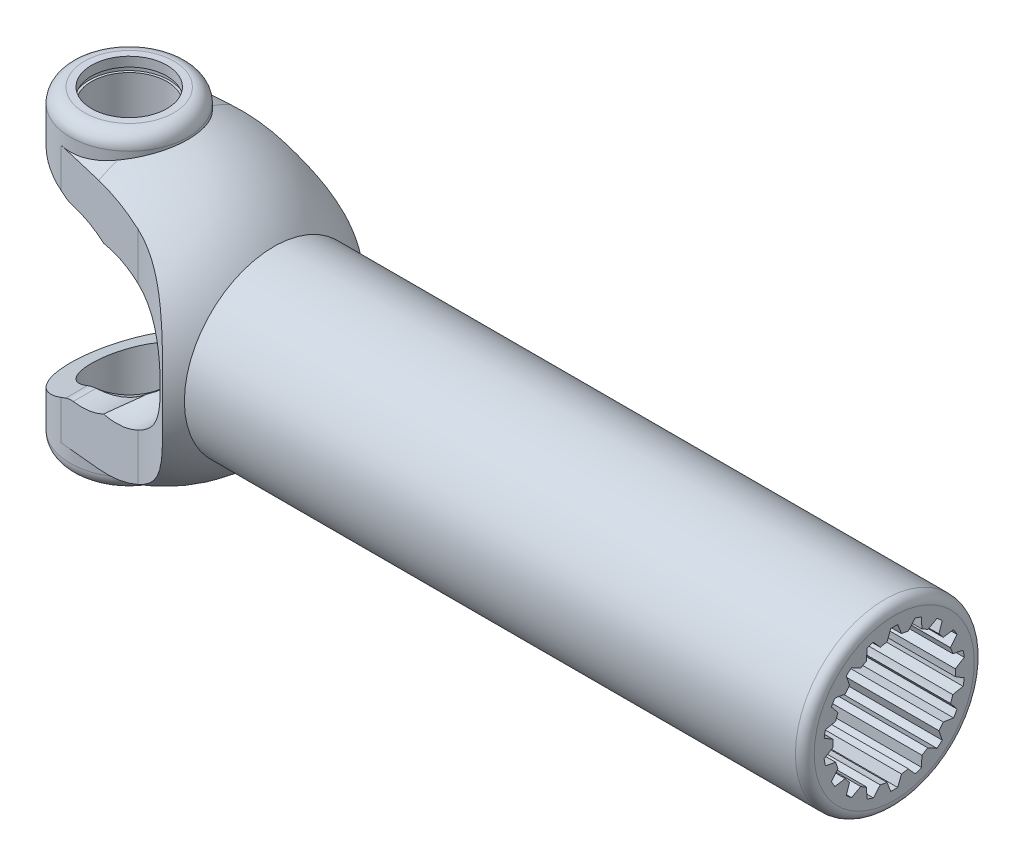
from build123d import *
from build123d.topology import SkipClean

# Parameters (mm, degrees)
CUT_EXTRUDE1_DEPTH      = 168.94716431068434
CUT_EXTRUDE1_DEPTH_BACK = 168.94716431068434
CUT_EXTRUDE2_DEPTH      = 167.62907912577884
CUT_EXTRUDE2_DEPTH_BACK = 167.62907912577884
FILLET1_R               = 5
SKETCH5_R               = 8
CUT_EXTRUDE3_DEPTH      = 177.69535931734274
SKETCH6_W               = 0.5
SKETCH6_H               = 1
CUT_EXTRUDE4_DEPTH      = 110
CIRPATTERN1_COUNT       = 18
FILLET2_R               = 2


with BuildPart() as part:
    # Sketch1 → Revolve1 (revolve)
    with BuildSketch(Plane.XY, mode=Mode.PRIVATE) as revolve1_sk:
        with BuildLine():
            Line((-12.5, 0), (162.49999999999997, 0))
            Line((162.49999999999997, 0), (162.5, 19))
            Line((162.5, 19), (30.716373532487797, 19))
            ThreePointArc((30.716373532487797, 19), (20.345232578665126, 27.110883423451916), (7.4999999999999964, 30.000000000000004))
            Line((7.4999999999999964, 30.000000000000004), (-12.500000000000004, 30))
            Line((-12.500000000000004, 30), (-12.5, 0))
        make_face()
    revolve(revolve1_sk.sketch.rotate(Axis((-12.5, 0, 0), (1, 0, 0)), 90), axis=Axis((-12.5, 0, 0), (1, 0, 0)))

    # Sketch2 → Cut-Extrude1 (cut, two sides: drawn at the far end of the back side and taken through both)
    with BuildSketch(Plane(origin=(0, 0, 0), x_dir=(1, 0, 0), z_dir=(0, 1, 0)).offset(-CUT_EXTRUDE1_DEPTH_BACK)):
        with BuildLine():
            Line((28.500000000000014, -21.424285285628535), (28.500000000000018, -41.42428528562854))
            Line((28.500000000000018, -41.42428528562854), (-41.499999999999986, -41.42428528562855))
            Line((-41.499999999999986, -41.42428528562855), (-41.499999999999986, 41.42428528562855))
            Line((-41.499999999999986, 41.42428528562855), (28.500000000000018, 41.42428528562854))
            Line((28.500000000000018, 41.42428528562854), (28.500000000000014, 21.424285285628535))
            ThreePointArc((28.500000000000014, 21.424285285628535), (23.504274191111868, 17.71131837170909), (17.60901080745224, 15.714002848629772))
            Line((17.60901080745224, 15.714002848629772), (-2.1199172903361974, 12.31892652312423))
            ThreePointArc((-2.1199172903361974, 12.31892652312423), (-12.5, 1.53e-15), (-2.1199172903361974, -12.31892652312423))
            Line((-2.1199172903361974, -12.31892652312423), (17.60901080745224, -15.714002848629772))
            ThreePointArc((17.60901080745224, -15.714002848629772), (23.504274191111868, -17.71131837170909), (28.500000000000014, -21.424285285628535))
        make_face()
    extrude(amount=CUT_EXTRUDE1_DEPTH + CUT_EXTRUDE1_DEPTH_BACK, mode=Mode.SUBTRACT)

    # Sketch3 → Cut-Extrude2 (cut, two sides: drawn at the far end of the back side and taken through both)
    with BuildSketch(Plane.XY.offset(-CUT_EXTRUDE2_DEPTH_BACK)):
        Polygon((-12.499999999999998, 24), (3.9e-15, 18), (8.24e-15, -18.000000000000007), (-12.499999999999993, -24.000000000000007), align=None)
    extrude(amount=CUT_EXTRUDE2_DEPTH + CUT_EXTRUDE2_DEPTH_BACK, mode=Mode.SUBTRACT)

    # Sketch7 → Cut-Revolve2 (revolve, cut)
    with BuildSketch(Plane(origin=(0, 0, 0), x_dir=(0, 0, -1), z_dir=(1, 1.2e-16, 0))):
        with BuildLine():
            Line((-20.000000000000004, 18.000000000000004), (-8, 18.000000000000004))
            ThreePointArc((-8, 18.000000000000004), (1.21e-15, 19.69771560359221), (8, 18.000000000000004))
            Line((8, 18.000000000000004), (20.000000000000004, 18.000000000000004))
            Line((20.000000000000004, 18.000000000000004), (20, -3.47e-15))
            Line((20, -3.47e-15), (-20, -3.47e-15))
            Line((-20, -3.47e-15), (-20.000000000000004, 18.000000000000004))
        make_face()
    revolve(axis=Axis((0, -3.47e-15, 20), (0, 0, -1)), mode=Mode.SUBTRACT)

    # Fillet1
    fillet1_edges = [part.edges().sort_by_distance(p)[0] for p in [
        (8.24e-15, -18.000000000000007, 10.341867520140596),
        (8.24e-15, -18.000000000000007, -10.341867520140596),
        (3.9e-15, 18, -10.341867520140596),
        (3.9e-15, 18, 10.341867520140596),
    ]]
    fillet(fillet1_edges, radius=FILLET1_R)

    # Sketch4 → Revolve2 (revolve)
    with SkipClean():  # the faces are left unmerged after this step: merging them gives an invalid solid
        with BuildSketch(Plane.XY, mode=Mode.PRIVATE) as revolve2_sk:
            with BuildLine():
                Line((-9.500000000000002, 33), (-4e-17, 33))
                Line((-4e-17, 33), (1.1e-15, 23.99999999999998))
                Line((1.1e-15, 23.99999999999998), (-12.499999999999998, 23.999999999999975))
                Line((-12.499999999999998, 23.999999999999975), (-12.500000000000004, 30))
                ThreePointArc((-12.500000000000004, 30), (-11.621320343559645, 32.121320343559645), (-9.500000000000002, 33))
            make_face()
        revolve2 = revolve(revolve2_sk.sketch.rotate(Axis((-4e-17, 33, 0), (1.3e-16, -1, 0)), 279.764178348), axis=Axis((-4e-17, 33, 0), (1.3e-16, -1, 0)))

    # Mirror1: Revolve2 across plane
    add(revolve2.mirror(Plane.ZX))

    # Sketch5 → Cut-Extrude3 (cut, through all)
    with BuildSketch(Plane(origin=(-4.2e-15, 33, 0), x_dir=(1, 1.3e-16, 0), z_dir=(-1.3e-16, 1, 0))):
        with Locations(Location((0, 0, 0), (0, 0, 180))):
            Circle(SKETCH5_R)
    extrude(amount=-CUT_EXTRUDE3_DEPTH, mode=Mode.SUBTRACT)

    # Sketch6 → Cut-Revolve1 (revolve, cut)
    with BuildSketch(Plane.XY, mode=Mode.PRIVATE) as cut_revolve1_sk:
        with Locations((8.25, 30.500000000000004)):
            Rectangle(SKETCH6_W, SKETCH6_H)
        with Locations((8.25, -30.500000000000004)):
            Rectangle(SKETCH6_W, SKETCH6_H)
    revolve(cut_revolve1_sk.sketch.rotate(Axis((0, 0, 0), (0, 1, 0)), 180), axis=Axis((0, 0, 0), (0, 1, 0)), mode=Mode.SUBTRACT)

    # Sketch8 → Cut-Revolve3 (revolve, cut)
    with BuildSketch(Plane(origin=(0, 0, 0), x_dir=(1, 0, 0), z_dir=(0, 1, 0))):
        with BuildLine():
            Line((19.37395372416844, 3.5566721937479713), (6.383572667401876, 11.056672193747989))
            Line((6.383572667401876, 11.056672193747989), (14.563591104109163, 25.224879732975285))
            Line((14.563591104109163, 25.224879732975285), (25.500000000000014, 18.910741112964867))
            ThreePointArc((25.500000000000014, 18.910741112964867), (24.097569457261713, 10.571154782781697), (19.37395372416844, 3.5566721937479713))
        make_face()
    cut_revolve3 = revolve(axis=Axis((-11.032946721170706, 0, 19.109624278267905), (0.500000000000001, 0, -0.8660254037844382)), mode=Mode.SUBTRACT)

    # Mirror2: Cut-Revolve3 across plane
    add(cut_revolve3.mirror(Plane.XY), mode=Mode.SUBTRACT)

    # Sketch9 → Cut-Extrude4 (cut)
    with BuildSketch(Plane(origin=(162.49999999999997, 0, 0), x_dir=(0, 0, -1), z_dir=(1, 0, 0))):
        with BuildLine():
            Line((0.7327465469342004, 14.982092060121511), (1.5392515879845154, 12.90855160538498))
            ThreePointArc((1.5392515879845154, 12.90855160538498), (-2.39e-15, -13), (-1.5392515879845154, 12.90855160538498))
            Line((-1.5392515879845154, 12.90855160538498), (-0.7327465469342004, 14.982092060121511))
            ThreePointArc((-0.7327465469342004, 14.982092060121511), (9.2e-16, 15), (0.7327465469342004, 14.982092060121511))
        make_face()
    cut_extrude4 = extrude(amount=-CUT_EXTRUDE4_DEPTH, mode=Mode.SUBTRACT)

    # CirPattern1: Cut-Extrude4 ×18 about axis
    cirpattern1_axis = Axis((0, -1e-16, 5e-17), (1, 0, 0))
    for i in range(1, CIRPATTERN1_COUNT):
        add(cut_extrude4.rotate(cirpattern1_axis, i * 360 / CIRPATTERN1_COUNT), mode=Mode.SUBTRACT)

    # Fillet2
    fillet2_edges = [part.edges().sort_by_distance(p)[0] for p in [
        (162.5, -4.44e-15, -19),
    ]]
    fillet(fillet2_edges, radius=FILLET2_R)


solid = part.part
